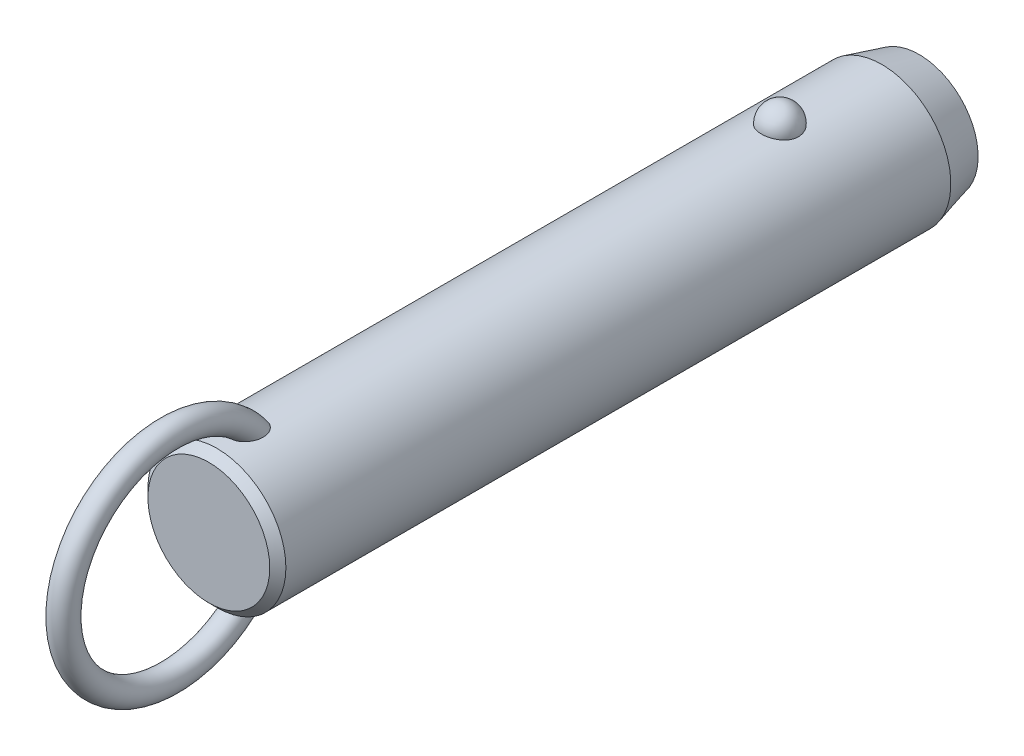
ISO-10303-21;
HEADER;
FILE_DESCRIPTION(('STEP AP214'),'2;1');
FILE_NAME('part.step','',(''),(''),'','','');
FILE_SCHEMA(('AUTOMOTIVE_DESIGN { 1 0 10303 214 1 1 1 1 }'));
ENDSEC;
DATA;
#1=APPLICATION_CONTEXT('core data for automotive mechanical design processes');
#2=APPLICATION_PROTOCOL_DEFINITION('international standard','automotive_design',2000,#1);
#3=PRODUCT_CONTEXT('',#1,'mechanical');
#4=PRODUCT('Part','Part','',(#3));
#5=PRODUCT_RELATED_PRODUCT_CATEGORY('part','',(#4));
#6=PRODUCT_DEFINITION_FORMATION('','',#4);
#7=PRODUCT_DEFINITION_CONTEXT('part definition',#1,'design');
#8=PRODUCT_DEFINITION('design','',#6,#7);
#9=PRODUCT_DEFINITION_SHAPE('','',#8);
#10=(LENGTH_UNIT() NAMED_UNIT(*) SI_UNIT(.MILLI.,.METRE.));
#11=(NAMED_UNIT(*) PLANE_ANGLE_UNIT() SI_UNIT($,.RADIAN.));
#12=(NAMED_UNIT(*) SI_UNIT($,.STERADIAN.) SOLID_ANGLE_UNIT());
#13=UNCERTAINTY_MEASURE_WITH_UNIT(LENGTH_MEASURE(1.E-05),#10,'distance_accuracy_value','');
#14=(GEOMETRIC_REPRESENTATION_CONTEXT(3) GLOBAL_UNCERTAINTY_ASSIGNED_CONTEXT((#13)) GLOBAL_UNIT_ASSIGNED_CONTEXT((#10,
#11,#12)) REPRESENTATION_CONTEXT('',''));
#15=CARTESIAN_POINT('',(0.,0.,0.));
#16=DIRECTION('',(0.,0.,1.));
#17=DIRECTION('',(1.,0.,0.));
#18=AXIS2_PLACEMENT_3D('',#15,#16,#17);
#19=CARTESIAN_POINT('',(0.,0.,76.2));
#20=DIRECTION('',(0.,0.,-1.));
#21=DIRECTION('',(-1.,0.,0.));
#22=AXIS2_PLACEMENT_3D('',#19,#20,#21);
#23=CYLINDRICAL_SURFACE('',#22,11.1);
#24=CARTESIAN_POINT('',(2.9724815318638,10.6945945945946,-3.));
#25=CARTESIAN_POINT('',(2.9724783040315,10.6945972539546,-2.83225059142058));
#26=CARTESIAN_POINT('',(2.95876598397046,10.6984356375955,-2.6644597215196));
#27=CARTESIAN_POINT('',(2.90424529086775,10.7133624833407,-2.33362381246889));
#28=CARTESIAN_POINT('',(2.8634252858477,10.7244540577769,-2.1705808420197));
#29=CARTESIAN_POINT('',(2.75573657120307,10.7526272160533,-1.85396767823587));
#30=CARTESIAN_POINT('',(2.68887937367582,10.7697061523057,-1.70039333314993));
#31=CARTESIAN_POINT('',(2.53079696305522,10.8079438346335,-1.40691598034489));
#32=CARTESIAN_POINT('',(2.43957264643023,10.8291024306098,-1.2670124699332));
#33=CARTESIAN_POINT('',(2.23458150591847,10.8732541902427,-1.00409565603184));
#34=CARTESIAN_POINT('',(2.12071295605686,10.8962553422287,-0.881162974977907));
#35=CARTESIAN_POINT('',(1.87365402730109,10.9414421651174,-0.656352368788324));
#36=CARTESIAN_POINT('',(1.74046358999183,10.9636278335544,-0.554474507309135));
#37=CARTESIAN_POINT('',(1.45872188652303,11.0046495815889,-0.374872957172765));
#38=CARTESIAN_POINT('',(1.31021276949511,11.0234944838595,-0.297085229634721));
#39=CARTESIAN_POINT('',(1.00170030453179,11.0557957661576,-0.167529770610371));
#40=CARTESIAN_POINT('',(0.841698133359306,11.0692526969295,-0.115759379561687));
#41=CARTESIAN_POINT('',(0.517607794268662,11.0890932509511,-0.0403925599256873));
#42=CARTESIAN_POINT('',(0.353633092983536,11.0955916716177,-0.0163383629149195));
#43=CARTESIAN_POINT('',(0.0238420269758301,11.1011989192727,0.00445177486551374));
#44=CARTESIAN_POINT('',(-0.141974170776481,11.1003084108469,0.00119017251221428));
#45=CARTESIAN_POINT('',(-0.46840517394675,11.0912990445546,-0.0323233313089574));
#46=CARTESIAN_POINT('',(-0.629059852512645,11.0832767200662,-0.0622147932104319));
#47=CARTESIAN_POINT('',(-0.942937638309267,11.0609962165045,-0.147645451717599));
#48=CARTESIAN_POINT('',(-1.09616062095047,11.0467379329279,-0.203185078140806));
#49=CARTESIAN_POINT('',(-1.39181061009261,11.0134071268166,-0.338752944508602));
#50=CARTESIAN_POINT('',(-1.53417383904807,10.9943086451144,-0.418913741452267));
#51=CARTESIAN_POINT('',(-1.80342160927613,10.9533667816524,-0.60144882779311));
#52=CARTESIAN_POINT('',(-1.9303046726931,10.9315231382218,-0.703825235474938));
#53=CARTESIAN_POINT('',(-2.16747598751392,10.887005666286,-0.930091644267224));
#54=CARTESIAN_POINT('',(-2.27742774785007,10.8643239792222,-1.05433291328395));
#55=CARTESIAN_POINT('',(-2.47517316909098,10.8209886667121,-1.31966633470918));
#56=CARTESIAN_POINT('',(-2.56296538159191,10.8003351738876,-1.46075958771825));
#57=CARTESIAN_POINT('',(-2.71500300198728,10.7631304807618,-1.75753646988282));
#58=CARTESIAN_POINT('',(-2.77898901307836,10.7466250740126,-1.91335887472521));
#59=CARTESIAN_POINT('',(-2.88046189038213,10.7198747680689,-2.2339152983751));
#60=CARTESIAN_POINT('',(-2.91794947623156,10.709629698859,-2.39864907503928));
#61=CARTESIAN_POINT('',(-2.96537819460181,10.6965949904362,-2.73165170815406));
#62=CARTESIAN_POINT('',(-2.97542891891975,10.693775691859,-2.89990378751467));
#63=CARTESIAN_POINT('',(-2.96804271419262,10.6958279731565,-3.235752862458));
#64=CARTESIAN_POINT('',(-2.95060646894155,10.7006993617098,-3.40334987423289));
#65=CARTESIAN_POINT('',(-2.88883358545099,10.71753912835,-3.73233906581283));
#66=CARTESIAN_POINT('',(-2.84462026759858,10.7294749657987,-3.89375610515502));
#67=CARTESIAN_POINT('',(-2.73050447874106,10.7590797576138,-4.20667949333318));
#68=CARTESIAN_POINT('',(-2.66060103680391,10.7767489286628,-4.35818546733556));
#69=CARTESIAN_POINT('',(-2.49642559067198,10.8159599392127,-4.6478542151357));
#70=CARTESIAN_POINT('',(-2.40203047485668,10.8375211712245,-4.78594458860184));
#71=CARTESIAN_POINT('',(-2.19143488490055,10.8820570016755,-5.0441038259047));
#72=CARTESIAN_POINT('',(-2.07523364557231,10.9050316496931,-5.16417205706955));
#73=CARTESIAN_POINT('',(-1.82361254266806,10.9499219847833,-5.38334833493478));
#74=CARTESIAN_POINT('',(-1.68812945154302,10.9718338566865,-5.4823846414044));
#75=CARTESIAN_POINT('',(-1.40191298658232,11.0120611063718,-5.65618873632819));
#76=CARTESIAN_POINT('',(-1.25118062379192,11.0303767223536,-5.73095813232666));
#77=CARTESIAN_POINT('',(-0.940570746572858,11.0611653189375,-5.85334725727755));
#78=CARTESIAN_POINT('',(-0.780821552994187,11.0737044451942,-5.90127578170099));
#79=CARTESIAN_POINT('',(-0.455204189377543,11.0918598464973,-5.96992976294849));
#80=CARTESIAN_POINT('',(-0.289336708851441,11.0974768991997,-5.99065827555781));
#81=CARTESIAN_POINT('',(0.0406846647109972,11.1011307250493,-6.00418773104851));
#82=CARTESIAN_POINT('',(0.20481742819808,11.099299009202,-5.99747318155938));
#83=CARTESIAN_POINT('',(0.529553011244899,11.088551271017,-5.9574031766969));
#84=CARTESIAN_POINT('',(0.690155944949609,11.0796354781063,-5.92404858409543));
#85=CARTESIAN_POINT('',(1.0027760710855,11.0557204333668,-5.83180084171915));
#86=CARTESIAN_POINT('',(1.15482001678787,11.0407414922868,-5.77299291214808));
#87=CARTESIAN_POINT('',(1.44678373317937,11.0062913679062,-5.63147366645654));
#88=CARTESIAN_POINT('',(1.58670279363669,10.9868199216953,-5.54876095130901));
#89=CARTESIAN_POINT('',(1.8527023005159,10.9451315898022,-5.36027644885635));
#90=CARTESIAN_POINT('',(1.97855158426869,10.9228788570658,-5.25418644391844));
#91=CARTESIAN_POINT('',(2.21080872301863,10.8782509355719,-5.02251354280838));
#92=CARTESIAN_POINT('',(2.31721312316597,10.8558757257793,-4.89692718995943));
#93=CARTESIAN_POINT('',(2.50945517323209,10.8130715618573,-4.62745408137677));
#94=CARTESIAN_POINT('',(2.59493284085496,10.7926798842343,-4.48330448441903));
#95=CARTESIAN_POINT('',(2.740862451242,10.7565495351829,-4.18236358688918));
#96=CARTESIAN_POINT('',(2.80132490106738,10.7408089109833,-4.02557762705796));
#97=CARTESIAN_POINT('',(2.88959070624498,10.7173718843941,-3.72475308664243));
#98=CARTESIAN_POINT('',(2.92062102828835,10.7088950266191,-3.58171216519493));
#99=CARTESIAN_POINT('',(2.96206765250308,10.6975052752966,-3.29245795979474));
#100=CARTESIAN_POINT('',(2.97248434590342,10.6945922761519,-3.14624473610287));
#101=CARTESIAN_POINT('',(2.9724815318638,10.6945945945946,-3.));
#102=B_SPLINE_CURVE_WITH_KNOTS('',3,(#24,#25,#26,#27,#28,#29,#30,#31,#32,#33,#34,#35,#36,#37,
#38,#39,#40,#41,#42,#43,#44,#45,#46,#47,#48,#49,#50,#51,#52,#53,#54,#55,#56,#57,#58,#59,#60,#61,
#62,#63,#64,#65,#66,#67,#68,#69,#70,#71,#72,#73,#74,#75,#76,#77,#78,#79,#80,#81,#82,#83,#84,#85,
#86,#87,#88,#89,#90,#91,#92,#93,#94,#95,#96,#97,#98,#99,#100,#101),.UNSPECIFIED.,.T.,.F.,(4,2,2,
2,2,2,2,2,2,2,2,2,2,2,2,2,2,2,2,2,2,2,2,2,2,2,2,2,2,2,2,2,2,2,2,2,2,2,4),(0.,0.502722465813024,
1.00566079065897,1.5083769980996,2.01107471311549,2.51608392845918,3.02109467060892,
3.52475118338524,4.02835620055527,4.52351860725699,5.0186364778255,5.50715297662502,
5.99567766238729,6.48688002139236,6.97812923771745,7.47814366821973,7.97819077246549,
8.48353712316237,8.98886974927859,9.49218093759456,9.99547960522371,10.4964777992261,
10.997494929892,11.5010810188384,12.0046847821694,12.5099796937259,13.0152411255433,
13.5145635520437,14.0138298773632,14.5043200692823,14.9947943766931,15.4836390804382,
15.9725123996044,16.4685040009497,16.9645836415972,17.4686765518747,17.972557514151,
18.410841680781,18.849117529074),.UNSPECIFIED.);
#103=CARTESIAN_POINT('',(2.9724815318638,10.6945945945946,-3.));
#104=VERTEX_POINT('',#103);
#105=EDGE_CURVE('E41',#104,#104,#102,.T.);
#106=ORIENTED_EDGE('',*,*,#105,.T.);
#107=EDGE_LOOP('',(#106));
#108=FACE_BOUND('',#107,.T.);
#109=CARTESIAN_POINT('',(0.,0.,87.6000000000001));
#110=DIRECTION('',(0.,0.,1.));
#111=DIRECTION('',(1.,0.,0.));
#112=AXIS2_PLACEMENT_3D('',#109,#110,#111);
#113=CIRCLE('',#112,11.1);
#114=CARTESIAN_POINT('',(11.1,0.,87.6000000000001));
#115=VERTEX_POINT('',#114);
#116=EDGE_CURVE('E10',#115,#115,#113,.F.);
#117=ORIENTED_EDGE('',*,*,#116,.T.);
#118=EDGE_LOOP('',(#117));
#119=FACE_BOUND('',#118,.T.);
#120=CARTESIAN_POINT('',(-0.564520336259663,-11.0856356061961,79.8578154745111));
#121=CARTESIAN_POINT('',(-0.667202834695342,-11.0804062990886,79.8912839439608));
#122=CARTESIAN_POINT('',(-0.766875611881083,-11.0738877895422,79.9338357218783));
#123=CARTESIAN_POINT('',(-0.957284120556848,-11.0590576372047,80.0354190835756));
#124=CARTESIAN_POINT('',(-1.04801616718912,-11.0507452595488,80.0944574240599));
#125=CARTESIAN_POINT('',(-1.21800952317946,-11.0333016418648,80.2265293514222));
#126=CARTESIAN_POINT('',(-1.29730805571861,-11.0241732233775,80.2995156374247));
#127=CARTESIAN_POINT('',(-1.44337665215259,-11.0060026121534,80.4570374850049));
#128=CARTESIAN_POINT('',(-1.51014622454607,-10.9969604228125,80.5415734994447));
#129=CARTESIAN_POINT('',(-1.63454620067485,-10.9791841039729,80.7255213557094));
#130=CARTESIAN_POINT('',(-1.69127003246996,-10.9705107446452,80.8255493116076));
#131=CARTESIAN_POINT('',(-1.78980785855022,-10.9548648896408,81.0327902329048));
#132=CARTESIAN_POINT('',(-1.83161214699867,-10.9478935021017,81.1400078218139));
#133=CARTESIAN_POINT('',(-1.91557028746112,-10.9335803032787,81.4054080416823));
#134=CARTESIAN_POINT('',(-1.95040620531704,-10.9273269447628,81.5659806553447));
#135=CARTESIAN_POINT('',(-1.99388326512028,-10.9194709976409,81.8906977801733));
#136=CARTESIAN_POINT('',(-2.00248051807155,-10.9178762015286,82.0548478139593));
#137=CARTESIAN_POINT('',(-1.99551615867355,-10.9191578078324,82.4246504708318));
#138=CARTESIAN_POINT('',(-1.9732206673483,-10.9232807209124,82.6301911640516));
#139=CARTESIAN_POINT('',(-1.91529761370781,-10.9335244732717,82.933595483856));
#140=CARTESIAN_POINT('',(-1.8918457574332,-10.9376266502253,83.0340883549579));
#141=CARTESIAN_POINT('',(-1.83700674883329,-10.9469720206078,83.232855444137));
#142=CARTESIAN_POINT('',(-1.80562070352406,-10.9522150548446,83.3311299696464));
#143=CARTESIAN_POINT('',(-1.73463055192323,-10.9636837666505,83.5259148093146));
#144=CARTESIAN_POINT('',(-1.69493416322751,-10.9699202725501,83.6223907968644));
#145=CARTESIAN_POINT('',(-1.6074514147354,-10.9830806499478,83.8116262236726));
#146=CARTESIAN_POINT('',(-1.55966150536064,-10.9900048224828,83.9043840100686));
#147=CARTESIAN_POINT('',(-1.45591812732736,-11.0042280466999,84.0846907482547));
#148=CARTESIAN_POINT('',(-1.40000013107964,-11.0115253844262,84.1722601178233));
#149=CARTESIAN_POINT('',(-1.27937470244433,-11.0261911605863,84.3410298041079));
#150=CARTESIAN_POINT('',(-1.21467835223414,-11.0335594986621,84.4222379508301));
#151=CARTESIAN_POINT('',(-1.08218150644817,-11.0473027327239,84.5690010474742));
#152=CARTESIAN_POINT('',(-1.01522633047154,-11.0537063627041,84.635309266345));
#153=CARTESIAN_POINT('',(-0.872952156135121,-11.065850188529,84.7583780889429));
#154=CARTESIAN_POINT('',(-0.797642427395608,-11.0715911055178,84.8151491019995));
#155=CARTESIAN_POINT('',(-0.651396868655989,-11.081071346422,84.9075155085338));
#156=CARTESIAN_POINT('',(-0.58171263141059,-11.0849841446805,84.9450491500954));
#157=CARTESIAN_POINT('',(-0.437066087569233,-11.0916271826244,85.0082594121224));
#158=CARTESIAN_POINT('',(-0.362109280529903,-11.0943586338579,85.0339481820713));
#159=CARTESIAN_POINT('',(-0.207828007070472,-11.0983242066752,85.071117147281));
#160=CARTESIAN_POINT('',(-0.128467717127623,-11.0995432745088,85.0824545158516));
#161=CARTESIAN_POINT('',(0.030910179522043,-11.1002423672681,85.0889658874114));
#162=CARTESIAN_POINT('',(0.110927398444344,-11.0997233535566,85.0841488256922));
#163=CARTESIAN_POINT('',(0.256406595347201,-11.097240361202,85.0609599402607));
#164=CARTESIAN_POINT('',(0.322235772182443,-11.0955074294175,85.0447543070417));
#165=CARTESIAN_POINT('',(0.450635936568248,-11.0910350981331,85.0026008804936));
#166=CARTESIAN_POINT('',(0.513205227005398,-11.0882951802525,84.9766480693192));
#167=CARTESIAN_POINT('',(0.662626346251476,-11.0805620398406,84.9026073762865));
#168=CARTESIAN_POINT('',(0.747127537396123,-11.0751144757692,84.8498452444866));
#169=CARTESIAN_POINT('',(0.906756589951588,-11.0631932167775,84.7317206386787));
#170=CARTESIAN_POINT('',(0.981859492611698,-11.0567168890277,84.6663257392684));
#171=CARTESIAN_POINT('',(1.10712207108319,-11.0447856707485,84.5422633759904));
#172=CARTESIAN_POINT('',(1.15909566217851,-11.0394280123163,84.4853831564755));
#173=CARTESIAN_POINT('',(1.25791923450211,-11.0286040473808,84.3673271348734));
#174=CARTESIAN_POINT('',(1.3047664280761,-11.0231376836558,84.3061490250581));
#175=CARTESIAN_POINT('',(1.43818612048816,-11.0068027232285,84.117305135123));
#176=CARTESIAN_POINT('',(1.5175176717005,-10.9960104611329,83.9844531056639));
#177=CARTESIAN_POINT('',(1.63597546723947,-10.9788847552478,83.7531371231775));
#178=CARTESIAN_POINT('',(1.6798887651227,-10.9722190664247,83.6570530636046));
#179=CARTESIAN_POINT('',(1.75953241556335,-10.9597298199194,83.4614311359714));
#180=CARTESIAN_POINT('',(1.79525967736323,-10.9539065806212,83.3618919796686));
#181=CARTESIAN_POINT('',(1.85844731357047,-10.9433632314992,83.1602111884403));
#182=CARTESIAN_POINT('',(1.88591073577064,-10.9386427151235,83.0580705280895));
#183=CARTESIAN_POINT('',(1.9323432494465,-10.9305350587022,82.8518191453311));
#184=CARTESIAN_POINT('',(1.95131065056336,-10.9271481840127,82.7477080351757));
#185=CARTESIAN_POINT('',(1.99040203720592,-10.9201183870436,82.4654588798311));
#186=CARTESIAN_POINT('',(2.00221217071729,-10.9179256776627,82.2860370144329));
#187=CARTESIAN_POINT('',(1.99711676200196,-10.9188636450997,81.9277133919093));
#188=CARTESIAN_POINT('',(1.98026150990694,-10.9219849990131,81.748811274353));
#189=CARTESIAN_POINT('',(1.92151657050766,-10.9324473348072,81.4364514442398));
#190=CARTESIAN_POINT('',(1.88605081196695,-10.9386915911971,81.3017594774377));
#191=CARTESIAN_POINT('',(1.7939302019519,-10.9541780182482,81.0399669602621));
#192=CARTESIAN_POINT('',(1.73729868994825,-10.9634168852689,80.9128582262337));
#193=CARTESIAN_POINT('',(1.61237037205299,-10.9824218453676,80.6894184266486));
#194=CARTESIAN_POINT('',(1.54715374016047,-10.9918945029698,80.5913455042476));
#195=CARTESIAN_POINT('',(1.40127026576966,-11.0114415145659,80.4074341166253));
#196=CARTESIAN_POINT('',(1.32060742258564,-11.0215157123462,80.3215924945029));
#197=CARTESIAN_POINT('',(1.14474787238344,-11.041168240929,80.1651630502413));
#198=CARTESIAN_POINT('',(1.04947805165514,-11.0507437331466,80.0946565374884));
#199=CARTESIAN_POINT('',(0.847278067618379,-11.0680789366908,79.972640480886));
#200=CARTESIAN_POINT('',(0.740351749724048,-11.0758392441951,79.9211246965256));
#201=CARTESIAN_POINT('',(0.529289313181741,-11.0878275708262,79.8434852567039));
#202=CARTESIAN_POINT('',(0.425895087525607,-11.0923259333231,79.815377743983));
#203=CARTESIAN_POINT('',(0.215723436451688,-11.0984001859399,79.7777038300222));
#204=CARTESIAN_POINT('',(0.108947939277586,-11.0999777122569,79.7681270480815));
#205=CARTESIAN_POINT('',(-0.0938962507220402,-11.1000196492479,79.7678773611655));
#206=CARTESIAN_POINT('',(-0.189967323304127,-11.0987797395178,79.7754089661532));
#207=CARTESIAN_POINT('',(-0.379657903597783,-11.0939111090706,79.8055079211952));
#208=CARTESIAN_POINT('',(-0.473277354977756,-11.0902823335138,79.8280756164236));
#209=CARTESIAN_POINT('',(-0.564520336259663,-11.0856356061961,79.8578154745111));
#210=B_SPLINE_CURVE_WITH_KNOTS('',3,(#120,#121,#122,#123,#124,#125,#126,#127,#128,#129,#130,
#131,#132,#133,#134,#135,#136,#137,#138,#139,#140,#141,#142,#143,#144,#145,#146,#147,#148,#149,
#150,#151,#152,#153,#154,#155,#156,#157,#158,#159,#160,#161,#162,#163,#164,#165,#166,#167,#168,
#169,#170,#171,#172,#173,#174,#175,#176,#177,#178,#179,#180,#181,#182,#183,#184,#185,#186,#187,
#188,#189,#190,#191,#192,#193,#194,#195,#196,#197,#198,#199,#200,#201,#202,#203,#204,#205,#206,
#207,#208,#209),.UNSPECIFIED.,.T.,.F.,(4,2,2,2,2,2,2,2,2,2,2,2,2,2,2,2,2,2,2,2,2,2,2,2,2,2,2,2,
2,2,2,2,2,2,2,2,2,2,2,2,2,2,2,2,4),(0.,0.323999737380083,0.648132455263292,0.971184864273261,
1.29424994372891,1.6388623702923,1.98369857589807,2.47426059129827,2.96564271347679,
3.58257396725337,3.89215258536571,4.20168803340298,4.51486273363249,4.82817514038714,
5.14015911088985,5.45175282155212,5.73442856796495,6.01679375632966,6.25364580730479,
6.49025437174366,6.72919963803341,6.96801276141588,7.17061258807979,7.37331685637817,
7.6709498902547,7.96935728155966,8.20075067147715,8.43226927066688,8.89581623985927,
9.21306533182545,9.53043400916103,9.84768549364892,10.1650000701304,10.70229304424,
11.2386443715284,11.6553390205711,12.0715755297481,12.4245637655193,12.7774607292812,
13.1321855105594,13.4867936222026,13.8068771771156,14.1267813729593,14.4146787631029,
14.7025827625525),.UNSPECIFIED.);
#211=CARTESIAN_POINT('',(-0.564520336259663,-11.0856356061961,79.8578154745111));
#212=VERTEX_POINT('',#211);
#213=EDGE_CURVE('E60',#212,#212,#210,.T.);
#214=ORIENTED_EDGE('',*,*,#213,.T.);
#215=EDGE_LOOP('',(#214));
#216=FACE_BOUND('',#215,.T.);
#217=CARTESIAN_POINT('',(-0.564520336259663,11.0856356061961,79.8578154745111));
#218=CARTESIAN_POINT('',(-0.468542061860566,11.0905203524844,79.8265456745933));
#219=CARTESIAN_POINT('',(-0.36979381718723,11.0942886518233,79.8031576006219));
#220=CARTESIAN_POINT('',(-0.169555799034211,11.0991586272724,79.7730858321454));
#221=CARTESIAN_POINT('',(-0.0680604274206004,11.1002543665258,79.7664393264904));
#222=CARTESIAN_POINT('',(0.134549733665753,11.099646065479,79.7701579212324));
#223=CARTESIAN_POINT('',(0.235664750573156,11.0979441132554,79.7805103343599));
#224=CARTESIAN_POINT('',(0.43463240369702,11.0919342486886,79.8178318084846));
#225=CARTESIAN_POINT('',(0.53248665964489,11.0876276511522,79.8447924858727));
#226=CARTESIAN_POINT('',(0.72244585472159,11.0768742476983,79.9144096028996));
#227=CARTESIAN_POINT('',(0.814543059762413,11.0704246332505,79.9570866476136));
#228=CARTESIAN_POINT('',(0.990565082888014,11.0560659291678,80.0566487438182));
#229=CARTESIAN_POINT('',(1.07448844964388,11.048156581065,80.1135363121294));
#230=CARTESIAN_POINT('',(1.23562672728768,11.0313221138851,80.2422106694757));
#231=CARTESIAN_POINT('',(1.31242684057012,11.0223686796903,80.3145117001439));
#232=CARTESIAN_POINT('',(1.45398030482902,11.0045918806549,80.4700425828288));
#233=CARTESIAN_POINT('',(1.51873073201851,10.9957685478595,80.5532750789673));
#234=CARTESIAN_POINT('',(1.64107232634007,10.9782087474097,80.7363842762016));
#235=CARTESIAN_POINT('',(1.69743176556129,10.9695572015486,80.8370893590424));
#236=CARTESIAN_POINT('',(1.79515063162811,10.9539887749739,81.0456264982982));
#237=CARTESIAN_POINT('',(1.83649966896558,10.9470730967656,81.1534634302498));
#238=CARTESIAN_POINT('',(1.91931148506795,10.9329211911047,81.4203995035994));
#239=CARTESIAN_POINT('',(1.9534010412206,10.9267904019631,81.5818612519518));
#240=CARTESIAN_POINT('',(1.99526195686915,10.9192174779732,81.9082163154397));
#241=CARTESIAN_POINT('',(2.00298989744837,10.9177830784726,82.0731148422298));
#242=CARTESIAN_POINT('',(1.99396251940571,10.9194420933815,82.4441006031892));
#243=CARTESIAN_POINT('',(1.97050829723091,10.923774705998,82.6500387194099));
#244=CARTESIAN_POINT('',(1.91079643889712,10.9343131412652,82.9539019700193));
#245=CARTESIAN_POINT('',(1.88673702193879,10.9385106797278,83.0545296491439));
#246=CARTESIAN_POINT('',(1.83065508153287,10.9480376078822,83.2535107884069));
#247=CARTESIAN_POINT('',(1.79863369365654,10.9533668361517,83.351864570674));
#248=CARTESIAN_POINT('',(1.72633365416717,10.9649954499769,83.546720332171));
#249=CARTESIAN_POINT('',(1.68596409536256,10.9713053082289,83.6431879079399));
#250=CARTESIAN_POINT('',(1.5970799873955,10.9845964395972,83.8323233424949));
#251=CARTESIAN_POINT('',(1.54856169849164,10.9915780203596,83.9249894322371));
#252=CARTESIAN_POINT('',(1.44330168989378,11.0058935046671,84.1049752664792));
#253=CARTESIAN_POINT('',(1.38659749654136,11.0132257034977,84.192316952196));
#254=CARTESIAN_POINT('',(1.26431158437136,11.0279330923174,84.3604563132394));
#255=CARTESIAN_POINT('',(1.19874160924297,11.0353082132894,84.4412624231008));
#256=CARTESIAN_POINT('',(1.06542088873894,11.0489310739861,84.5859856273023));
#257=CARTESIAN_POINT('',(0.998640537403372,11.0552153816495,84.650784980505));
#258=CARTESIAN_POINT('',(0.856896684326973,11.0671032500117,84.770846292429));
#259=CARTESIAN_POINT('',(0.781942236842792,11.0727075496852,84.8261186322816));
#260=CARTESIAN_POINT('',(0.636276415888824,11.081949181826,84.9159721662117));
#261=CARTESIAN_POINT('',(0.5667558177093,11.0857572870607,84.9524410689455));
#262=CARTESIAN_POINT('',(0.422602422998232,11.0921860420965,85.0135333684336));
#263=CARTESIAN_POINT('',(0.347974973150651,11.0948079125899,85.0381689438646));
#264=CARTESIAN_POINT('',(0.194593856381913,11.0985608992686,85.0733233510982));
#265=CARTESIAN_POINT('',(0.115807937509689,11.0996777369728,85.0837069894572));
#266=CARTESIAN_POINT('',(-0.0422499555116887,11.1002003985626,85.0885747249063));
#267=CARTESIAN_POINT('',(-0.121521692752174,11.09960699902,85.083066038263));
#268=CARTESIAN_POINT('',(-0.266046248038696,11.0970123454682,85.0588271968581));
#269=CARTESIAN_POINT('',(-0.331661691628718,11.0952283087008,85.0421356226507));
#270=CARTESIAN_POINT('',(-0.459588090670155,11.0906663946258,84.9991117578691));
#271=CARTESIAN_POINT('',(-0.521897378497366,11.0878880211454,84.972774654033));
#272=CARTESIAN_POINT('',(-0.671446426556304,11.0800342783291,84.8975130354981));
#273=CARTESIAN_POINT('',(-0.756250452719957,11.0744969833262,84.8438182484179));
#274=CARTESIAN_POINT('',(-0.916349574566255,11.0624045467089,84.7238029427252));
#275=CARTESIAN_POINT('',(-0.991618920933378,11.0558467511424,84.6574493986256));
#276=CARTESIAN_POINT('',(-1.11713140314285,11.0437783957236,84.5316335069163));
#277=CARTESIAN_POINT('',(-1.16920539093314,11.0383619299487,84.4739524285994));
#278=CARTESIAN_POINT('',(-1.26817476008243,11.02743010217,84.3542809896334));
#279=CARTESIAN_POINT('',(-1.31506731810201,11.0219146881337,84.2922883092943));
#280=CARTESIAN_POINT('',(-1.40399813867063,11.0109399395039,84.1647843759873));
#281=CARTESIAN_POINT('',(-1.4460286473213,11.0054807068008,84.0992677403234));
#282=CARTESIAN_POINT('',(-1.52538779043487,10.9947621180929,83.9654223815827));
#283=CARTESIAN_POINT('',(-1.56271516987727,10.9895028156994,83.8970929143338));
#284=CARTESIAN_POINT('',(-1.64537943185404,10.9774790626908,83.7332101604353));
#285=CARTESIAN_POINT('',(-1.68879497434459,10.9708503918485,83.6366735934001));
#286=CARTESIAN_POINT('',(-1.76740738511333,10.9584602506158,83.4402369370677));
#287=CARTESIAN_POINT('',(-1.80260120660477,10.95269910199,83.3403356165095));
#288=CARTESIAN_POINT('',(-1.86468657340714,10.9423003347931,83.1379663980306));
#289=CARTESIAN_POINT('',(-1.8915816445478,10.9376622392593,83.0354996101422));
#290=CARTESIAN_POINT('',(-1.93682458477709,10.9297405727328,82.8286429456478));
#291=CARTESIAN_POINT('',(-1.9551708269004,10.9264572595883,82.7242527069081));
#292=CARTESIAN_POINT('',(-1.99232562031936,10.9197647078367,82.4426287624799));
#293=CARTESIAN_POINT('',(-2.00294603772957,10.9177914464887,82.2641857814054));
#294=CARTESIAN_POINT('',(-1.99566675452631,10.9191290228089,81.9079962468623));
#295=CARTESIAN_POINT('',(-1.97781651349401,10.9224306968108,81.7302490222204));
#296=CARTESIAN_POINT('',(-1.91747214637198,10.9331592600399,81.4197921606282));
#297=CARTESIAN_POINT('',(-1.88131022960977,10.9395108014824,81.285825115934));
#298=CARTESIAN_POINT('',(-1.78790380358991,10.9551659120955,81.0255975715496));
#299=CARTESIAN_POINT('',(-1.7306830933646,10.9644661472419,80.8993285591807));
#300=CARTESIAN_POINT('',(-1.60475573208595,10.9835398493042,80.6774156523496));
#301=CARTESIAN_POINT('',(-1.53908879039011,10.9930297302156,80.5800265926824));
#302=CARTESIAN_POINT('',(-1.39238608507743,11.0125708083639,80.3975250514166));
#303=CARTESIAN_POINT('',(-1.31135150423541,11.0226219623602,80.3124116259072));
#304=CARTESIAN_POINT('',(-1.14382035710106,11.0411991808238,80.1652994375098));
#305=CARTESIAN_POINT('',(-1.05858500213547,11.0497792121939,80.1018693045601));
#306=CARTESIAN_POINT('',(-0.878723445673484,11.0655285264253,79.9902505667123));
#307=CARTESIAN_POINT('',(-0.784123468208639,11.0727015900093,79.9420208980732));
#308=CARTESIAN_POINT('',(-0.646163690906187,11.0812501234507,79.886023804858));
#309=CARTESIAN_POINT('',(-0.605595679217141,11.0835451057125,79.8711978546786));
#310=CARTESIAN_POINT('',(-0.564520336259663,11.0856356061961,79.8578154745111));
#311=B_SPLINE_CURVE_WITH_KNOTS('',3,(#217,#218,#219,#220,#221,#222,#223,#224,#225,#226,#227,
#228,#229,#230,#231,#232,#233,#234,#235,#236,#237,#238,#239,#240,#241,#242,#243,#244,#245,#246,
#247,#248,#249,#250,#251,#252,#253,#254,#255,#256,#257,#258,#259,#260,#261,#262,#263,#264,#265,
#266,#267,#268,#269,#270,#271,#272,#273,#274,#275,#276,#277,#278,#279,#280,#281,#282,#283,#284,
#285,#286,#287,#288,#289,#290,#291,#292,#293,#294,#295,#296,#297,#298,#299,#300,#301,#302,#303,
#304,#305,#306,#307,#308,#309,#310),.UNSPECIFIED.,.T.,.F.,(4,2,2,2,2,2,2,2,2,2,2,2,2,2,2,2,2,2,
2,2,2,2,2,2,2,2,2,2,2,2,2,2,2,2,2,2,2,2,2,2,2,2,2,2,2,2,4),(0.,0.303061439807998,
0.606795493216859,0.910302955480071,1.21365733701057,1.51741085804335,1.82121821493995,
2.1374520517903,2.45376252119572,2.79958678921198,3.14564996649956,3.63832391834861,
4.13180893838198,4.75031912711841,5.06071926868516,5.37107516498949,5.68500772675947,
5.99908475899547,6.31176519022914,6.62403542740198,6.90315673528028,7.1819719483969,
7.41687778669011,7.65154134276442,7.88841587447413,8.12518286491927,8.3275284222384,
8.52997509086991,8.82986421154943,9.13054668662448,9.36393502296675,9.59744991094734,
9.83133221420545,10.0652767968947,10.383032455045,10.7009056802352,11.0186436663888,
11.3364420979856,11.8705925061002,12.4038159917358,12.8189662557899,13.2336487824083,
13.5857049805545,13.9377340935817,14.2561354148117,14.5736690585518,14.7033687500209),.UNSPECIFIED.);
#312=CARTESIAN_POINT('',(-0.564520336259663,11.0856356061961,79.8578154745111));
#313=VERTEX_POINT('',#312);
#314=EDGE_CURVE('E67',#313,#313,#311,.T.);
#315=ORIENTED_EDGE('',*,*,#314,.T.);
#316=EDGE_LOOP('',(#315));
#317=FACE_BOUND('',#316,.T.);
#318=CARTESIAN_POINT('',(0.,0.,-19.4000000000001));
#319=DIRECTION('',(0.,0.,-1.));
#320=DIRECTION('',(-1.,0.,0.));
#321=AXIS2_PLACEMENT_3D('',#318,#319,#320);
#322=CIRCLE('',#321,11.1);
#323=CARTESIAN_POINT('',(-11.1,0.,-19.4000000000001));
#324=VERTEX_POINT('',#323);
#325=EDGE_CURVE('E57',#324,#324,#322,.F.);
#326=ORIENTED_EDGE('',*,*,#325,.T.);
#327=EDGE_LOOP('',(#326));
#328=FACE_BOUND('',#327,.T.);
#329=ADVANCED_FACE('F37',(#108,#119,#216,#317,#328),#23,.T.);
#330=CARTESIAN_POINT('',(0.,0.,-25.4));
#331=DIRECTION('',(0.,0.,-1.));
#332=DIRECTION('',(-1.,0.,0.));
#333=AXIS2_PLACEMENT_3D('',#330,#331,#332);
#334=PLANE('',#333);
#335=CARTESIAN_POINT('',(0.,0.,-25.4));
#336=DIRECTION('',(0.,0.,-1.));
#337=DIRECTION('',(-1.,0.,0.));
#338=AXIS2_PLACEMENT_3D('',#335,#336,#337);
#339=CIRCLE('',#338,9.49230484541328);
#340=CARTESIAN_POINT('',(-9.49230484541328,0.,-25.4));
#341=VERTEX_POINT('',#340);
#342=EDGE_CURVE('E66',#341,#341,#339,.T.);
#343=ORIENTED_EDGE('',*,*,#342,.T.);
#344=EDGE_LOOP('',(#343));
#345=FACE_BOUND('',#344,.T.);
#346=ADVANCED_FACE('F85',(#345),#334,.T.);
#347=CARTESIAN_POINT('',(0.,0.,-25.4));
#348=DIRECTION('',(0.,0.,1.));
#349=DIRECTION('',(1.,0.,0.));
#350=AXIS2_PLACEMENT_3D('',#347,#348,#349);
#351=CONICAL_SURFACE('',#350,9.49230484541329,0.26179938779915);
#352=ORIENTED_EDGE('',*,*,#325,.F.);
#353=EDGE_LOOP('',(#352));
#354=FACE_BOUND('',#353,.T.);
#355=ORIENTED_EDGE('',*,*,#342,.F.);
#356=EDGE_LOOP('',(#355));
#357=FACE_BOUND('',#356,.T.);
#358=ADVANCED_FACE('F83',(#354,#357),#351,.T.);
#359=CARTESIAN_POINT('',(0.,0.,88.9));
#360=DIRECTION('',(0.,0.,1.));
#361=DIRECTION('',(1.,0.,0.));
#362=AXIS2_PLACEMENT_3D('',#359,#360,#361);
#363=PLANE('',#362);
#364=CARTESIAN_POINT('',(0.,0.,88.9));
#365=DIRECTION('',(0.,0.,1.));
#366=DIRECTION('',(1.,0.,0.));
#367=AXIS2_PLACEMENT_3D('',#364,#365,#366);
#368=CIRCLE('',#367,9.80000000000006);
#369=CARTESIAN_POINT('',(9.80000000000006,0.,88.9));
#370=VERTEX_POINT('',#369);
#371=EDGE_CURVE('E50',#370,#370,#368,.T.);
#372=ORIENTED_EDGE('',*,*,#371,.T.);
#373=EDGE_LOOP('',(#372));
#374=FACE_BOUND('',#373,.T.);
#375=ADVANCED_FACE('F77',(#374),#363,.T.);
#376=CARTESIAN_POINT('',(0.,0.,95.25));
#377=DIRECTION('',(1.,0.,0.));
#378=DIRECTION('',(0.,0.,-1.));
#379=AXIS2_PLACEMENT_3D('',#376,#377,#378);
#380=TOROIDAL_SURFACE('',#379,17.05,2.);
#381=ORIENTED_EDGE('',*,*,#314,.F.);
#382=EDGE_LOOP('',(#381));
#383=FACE_BOUND('',#382,.T.);
#384=ORIENTED_EDGE('',*,*,#213,.F.);
#385=EDGE_LOOP('',(#384));
#386=FACE_BOUND('',#385,.T.);
#387=ADVANCED_FACE('F73',(#383,#386),#380,.T.);
#388=CARTESIAN_POINT('',(0.,0.,88.9));
#389=DIRECTION('',(0.,0.,-1.));
#390=DIRECTION('',(-1.,0.,0.));
#391=AXIS2_PLACEMENT_3D('',#388,#389,#390);
#392=CONICAL_SURFACE('',#391,9.80000000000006,0.785398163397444);
#393=ORIENTED_EDGE('',*,*,#116,.F.);
#394=EDGE_LOOP('',(#393));
#395=FACE_BOUND('',#394,.T.);
#396=ORIENTED_EDGE('',*,*,#371,.F.);
#397=EDGE_LOOP('',(#396));
#398=FACE_BOUND('',#397,.T.);
#399=ADVANCED_FACE('F39',(#395,#398),#392,.T.);
#400=CARTESIAN_POINT('',(0.,11.1,-3.));
#401=DIRECTION('',(0.,1.,0.));
#402=DIRECTION('',(0.,0.,-1.));
#403=AXIS2_PLACEMENT_3D('',#400,#401,#402);
#404=SPHERICAL_SURFACE('',#403,3.);
#405=ORIENTED_EDGE('',*,*,#105,.F.);
#406=EDGE_LOOP('',(#405));
#407=FACE_BOUND('',#406,.T.);
#408=ADVANCED_FACE('F79',(#407),#404,.T.);
#409=CLOSED_SHELL('',(#329,#346,#358,#375,#387,#399,#408));
#410=MANIFOLD_SOLID_BREP('B2',#409);
#411=ADVANCED_BREP_SHAPE_REPRESENTATION('',(#18,#410),#14);
#412=SHAPE_DEFINITION_REPRESENTATION(#9,#411);
ENDSEC;
END-ISO-10303-21;
